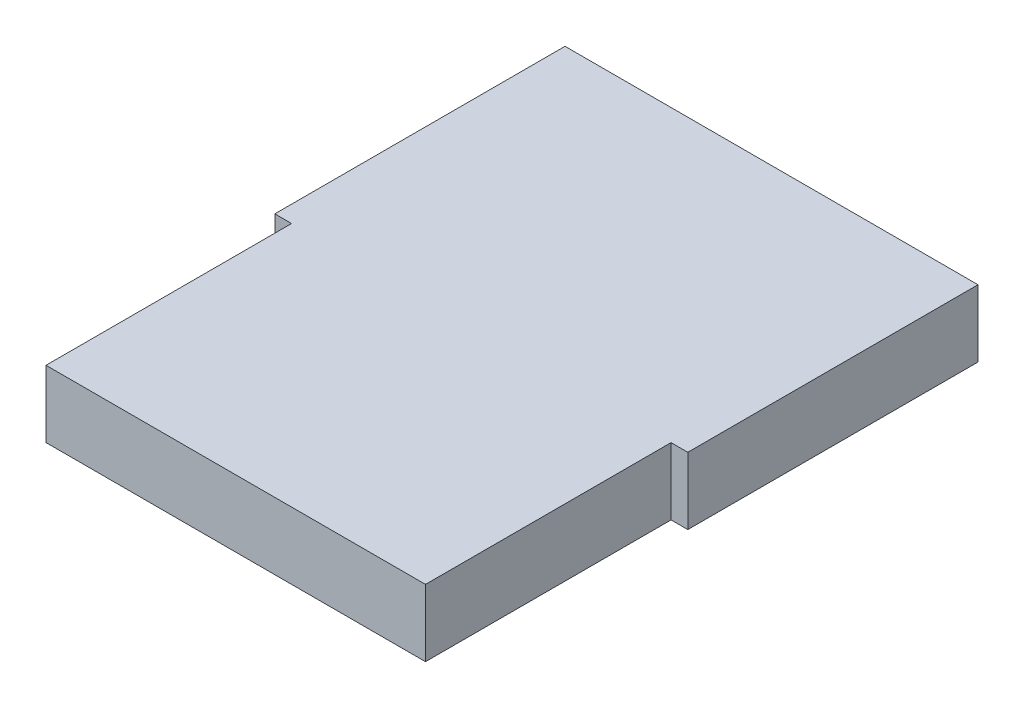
ISO-10303-21;
HEADER;
FILE_DESCRIPTION(('STEP AP214'),'2;1');
FILE_NAME('part.step','',(''),(''),'','','');
FILE_SCHEMA(('AUTOMOTIVE_DESIGN { 1 0 10303 214 1 1 1 1 }'));
ENDSEC;
DATA;
#1=APPLICATION_CONTEXT('core data for automotive mechanical design processes');
#2=APPLICATION_PROTOCOL_DEFINITION('international standard','automotive_design',2000,#1);
#3=PRODUCT_CONTEXT('',#1,'mechanical');
#4=PRODUCT('Part','Part','',(#3));
#5=PRODUCT_RELATED_PRODUCT_CATEGORY('part','',(#4));
#6=PRODUCT_DEFINITION_FORMATION('','',#4);
#7=PRODUCT_DEFINITION_CONTEXT('part definition',#1,'design');
#8=PRODUCT_DEFINITION('design','',#6,#7);
#9=PRODUCT_DEFINITION_SHAPE('','',#8);
#10=(LENGTH_UNIT() NAMED_UNIT(*) SI_UNIT(.MILLI.,.METRE.));
#11=(NAMED_UNIT(*) PLANE_ANGLE_UNIT() SI_UNIT($,.RADIAN.));
#12=(NAMED_UNIT(*) SI_UNIT($,.STERADIAN.) SOLID_ANGLE_UNIT());
#13=UNCERTAINTY_MEASURE_WITH_UNIT(LENGTH_MEASURE(1.E-05),#10,'distance_accuracy_value','');
#14=(GEOMETRIC_REPRESENTATION_CONTEXT(3) GLOBAL_UNCERTAINTY_ASSIGNED_CONTEXT((#13)) GLOBAL_UNIT_ASSIGNED_CONTEXT((#10,
#11,#12)) REPRESENTATION_CONTEXT('',''));
#15=CARTESIAN_POINT('',(0.,0.,0.));
#16=DIRECTION('',(0.,0.,1.));
#17=DIRECTION('',(1.,0.,0.));
#18=AXIS2_PLACEMENT_3D('',#15,#16,#17);
#19=CARTESIAN_POINT('',(-46.1103954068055,-22.5,4.));
#20=DIRECTION('',(0.,1.,0.));
#21=DIRECTION('',(-1.,0.,0.));
#22=AXIS2_PLACEMENT_3D('',#19,#20,#21);
#23=PLANE('',#22);
#24=DIRECTION('',(0.,0.,1.));
#25=VECTOR('',#24,1.);
#26=CARTESIAN_POINT('',(-44.6103954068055,-22.5,4.));
#27=LINE('',#26,#25);
#28=CARTESIAN_POINT('',(-44.6103954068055,-22.5,26.));
#29=VERTEX_POINT('',#28);
#30=CARTESIAN_POINT('',(-44.6103954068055,-22.5,48.));
#31=VERTEX_POINT('',#30);
#32=EDGE_CURVE('E55',#29,#31,#27,.T.);
#33=ORIENTED_EDGE('',*,*,#32,.F.);
#34=DIRECTION('',(-1.,0.,0.));
#35=VECTOR('',#34,1.);
#36=CARTESIAN_POINT('',(-46.1103954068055,-22.5,26.));
#37=LINE('',#36,#35);
#38=CARTESIAN_POINT('',(-46.1103954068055,-22.5,26.));
#39=VERTEX_POINT('',#38);
#40=EDGE_CURVE('E154',#29,#39,#37,.T.);
#41=ORIENTED_EDGE('',*,*,#40,.T.);
#42=DIRECTION('',(0.,0.,-1.));
#43=VECTOR('',#42,1.);
#44=CARTESIAN_POINT('',(-46.1103954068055,-22.5,4.));
#45=LINE('',#44,#43);
#46=CARTESIAN_POINT('',(-46.1103954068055,-22.5,0.));
#47=VERTEX_POINT('',#46);
#48=EDGE_CURVE('E126',#39,#47,#45,.T.);
#49=ORIENTED_EDGE('',*,*,#48,.T.);
#50=DIRECTION('',(1.,0.,0.));
#51=VECTOR('',#50,1.);
#52=CARTESIAN_POINT('',(-46.1103954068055,-22.5,0.));
#53=LINE('',#52,#51);
#54=CARTESIAN_POINT('',(-9.11039540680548,-22.5,0.));
#55=VERTEX_POINT('',#54);
#56=EDGE_CURVE('E124',#47,#55,#53,.T.);
#57=ORIENTED_EDGE('',*,*,#56,.T.);
#58=DIRECTION('',(0.,0.,-1.));
#59=VECTOR('',#58,1.);
#60=CARTESIAN_POINT('',(-9.11039540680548,-22.5,4.));
#61=LINE('',#60,#59);
#62=CARTESIAN_POINT('',(-9.11039540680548,-22.5,26.));
#63=VERTEX_POINT('',#62);
#64=EDGE_CURVE('E122',#63,#55,#61,.T.);
#65=ORIENTED_EDGE('',*,*,#64,.F.);
#66=DIRECTION('',(1.,0.,0.));
#67=VECTOR('',#66,1.);
#68=CARTESIAN_POINT('',(-46.1103954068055,-22.5,26.));
#69=LINE('',#68,#67);
#70=CARTESIAN_POINT('',(-10.6103954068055,-22.5,26.));
#71=VERTEX_POINT('',#70);
#72=EDGE_CURVE('E148',#71,#63,#69,.T.);
#73=ORIENTED_EDGE('',*,*,#72,.F.);
#74=DIRECTION('',(0.,0.,1.));
#75=VECTOR('',#74,1.);
#76=CARTESIAN_POINT('',(-10.6103954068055,-22.5,3.99999999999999));
#77=LINE('',#76,#75);
#78=CARTESIAN_POINT('',(-10.6103954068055,-22.5,48.));
#79=VERTEX_POINT('',#78);
#80=EDGE_CURVE('E166',#71,#79,#77,.T.);
#81=ORIENTED_EDGE('',*,*,#80,.T.);
#82=DIRECTION('',(1.,0.,0.));
#83=VECTOR('',#82,1.);
#84=CARTESIAN_POINT('',(-46.1103954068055,-22.5,48.));
#85=LINE('',#84,#83);
#86=EDGE_CURVE('E140',#31,#79,#85,.T.);
#87=ORIENTED_EDGE('',*,*,#86,.F.);
#88=EDGE_LOOP('',(#33,#41,#49,#57,#65,#73,#81,#87));
#89=FACE_BOUND('',#88,.T.);
#90=ADVANCED_FACE('F33',(#89),#23,.F.);
#91=CARTESIAN_POINT('',(-46.1103954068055,-16.5,48.));
#92=DIRECTION('',(0.,-1.,0.));
#93=DIRECTION('',(0.,0.,-1.));
#94=AXIS2_PLACEMENT_3D('',#91,#92,#93);
#95=PLANE('',#94);
#96=DIRECTION('',(0.,0.,1.));
#97=VECTOR('',#96,1.);
#98=CARTESIAN_POINT('',(-44.6103954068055,-16.5,0.));
#99=LINE('',#98,#97);
#100=CARTESIAN_POINT('',(-44.6103954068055,-16.5,26.));
#101=VERTEX_POINT('',#100);
#102=CARTESIAN_POINT('',(-44.6103954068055,-16.5,48.));
#103=VERTEX_POINT('',#102);
#104=EDGE_CURVE('E118',#101,#103,#99,.T.);
#105=ORIENTED_EDGE('',*,*,#104,.T.);
#106=DIRECTION('',(-1.,0.,0.));
#107=VECTOR('',#106,1.);
#108=CARTESIAN_POINT('',(-46.1103954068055,-16.5,48.));
#109=LINE('',#108,#107);
#110=CARTESIAN_POINT('',(-10.6103954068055,-16.5,48.));
#111=VERTEX_POINT('',#110);
#112=EDGE_CURVE('E138',#111,#103,#109,.T.);
#113=ORIENTED_EDGE('',*,*,#112,.F.);
#114=DIRECTION('',(0.,0.,1.));
#115=VECTOR('',#114,1.);
#116=CARTESIAN_POINT('',(-10.6103954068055,-16.5,0.));
#117=LINE('',#116,#115);
#118=CARTESIAN_POINT('',(-10.6103954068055,-16.5,26.));
#119=VERTEX_POINT('',#118);
#120=EDGE_CURVE('E143',#119,#111,#117,.T.);
#121=ORIENTED_EDGE('',*,*,#120,.F.);
#122=DIRECTION('',(1.,0.,0.));
#123=VECTOR('',#122,1.);
#124=CARTESIAN_POINT('',(0.,-16.5,26.));
#125=LINE('',#124,#123);
#126=CARTESIAN_POINT('',(-9.11039540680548,-16.5,26.));
#127=VERTEX_POINT('',#126);
#128=EDGE_CURVE('E107',#119,#127,#125,.T.);
#129=ORIENTED_EDGE('',*,*,#128,.T.);
#130=DIRECTION('',(0.,0.,-1.));
#131=VECTOR('',#130,1.);
#132=CARTESIAN_POINT('',(-9.11039540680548,-16.5,48.));
#133=LINE('',#132,#131);
#134=CARTESIAN_POINT('',(-9.11039540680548,-16.5,0.));
#135=VERTEX_POINT('',#134);
#136=EDGE_CURVE('E99',#127,#135,#133,.T.);
#137=ORIENTED_EDGE('',*,*,#136,.T.);
#138=DIRECTION('',(1.,0.,0.));
#139=VECTOR('',#138,1.);
#140=CARTESIAN_POINT('',(-27.6103954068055,-16.5,0.));
#141=LINE('',#140,#139);
#142=CARTESIAN_POINT('',(-46.1103954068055,-16.5,0.));
#143=VERTEX_POINT('',#142);
#144=EDGE_CURVE('E103',#143,#135,#141,.T.);
#145=ORIENTED_EDGE('',*,*,#144,.F.);
#146=DIRECTION('',(0.,0.,-1.));
#147=VECTOR('',#146,1.);
#148=CARTESIAN_POINT('',(-46.1103954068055,-16.5,48.));
#149=LINE('',#148,#147);
#150=CARTESIAN_POINT('',(-46.1103954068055,-16.5,26.));
#151=VERTEX_POINT('',#150);
#152=EDGE_CURVE('E48',#151,#143,#149,.T.);
#153=ORIENTED_EDGE('',*,*,#152,.F.);
#154=DIRECTION('',(-1.,0.,0.));
#155=VECTOR('',#154,1.);
#156=CARTESIAN_POINT('',(0.,-16.5,26.));
#157=LINE('',#156,#155);
#158=EDGE_CURVE('E266',#101,#151,#157,.T.);
#159=ORIENTED_EDGE('',*,*,#158,.F.);
#160=EDGE_LOOP('',(#105,#113,#121,#129,#137,#145,#153,#159));
#161=FACE_BOUND('',#160,.T.);
#162=ADVANCED_FACE('F102',(#161),#95,.F.);
#163=CARTESIAN_POINT('',(0.,0.,48.));
#164=DIRECTION('',(0.,0.,-1.));
#165=DIRECTION('',(-1.,0.,0.));
#166=AXIS2_PLACEMENT_3D('',#163,#164,#165);
#167=PLANE('',#166);
#168=DIRECTION('',(0.,1.,0.));
#169=VECTOR('',#168,1.);
#170=CARTESIAN_POINT('',(-44.6103954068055,0.,48.));
#171=LINE('',#170,#169);
#172=EDGE_CURVE('E11',#31,#103,#171,.T.);
#173=ORIENTED_EDGE('',*,*,#172,.F.);
#174=ORIENTED_EDGE('',*,*,#86,.T.);
#175=DIRECTION('',(0.,1.,0.));
#176=VECTOR('',#175,1.);
#177=CARTESIAN_POINT('',(-10.6103954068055,0.,48.));
#178=LINE('',#177,#176);
#179=EDGE_CURVE('E41',#79,#111,#178,.T.);
#180=ORIENTED_EDGE('',*,*,#179,.T.);
#181=ORIENTED_EDGE('',*,*,#112,.T.);
#182=EDGE_LOOP('',(#173,#174,#180,#181));
#183=FACE_BOUND('',#182,.T.);
#184=ADVANCED_FACE('F137',(#183),#167,.F.);
#185=CARTESIAN_POINT('',(-9.11039540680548,0.,4.));
#186=DIRECTION('',(-1.,0.,0.));
#187=DIRECTION('',(0.,-1.,0.));
#188=AXIS2_PLACEMENT_3D('',#185,#186,#187);
#189=PLANE('',#188);
#190=DIRECTION('',(0.,1.,0.));
#191=VECTOR('',#190,1.);
#192=CARTESIAN_POINT('',(-9.11039540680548,0.,0.));
#193=LINE('',#192,#191);
#194=EDGE_CURVE('E117',#55,#135,#193,.T.);
#195=ORIENTED_EDGE('',*,*,#194,.T.);
#196=ORIENTED_EDGE('',*,*,#136,.F.);
#197=DIRECTION('',(0.,1.,0.));
#198=VECTOR('',#197,1.);
#199=CARTESIAN_POINT('',(-9.11039540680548,-26.5,26.));
#200=LINE('',#199,#198);
#201=EDGE_CURVE('E164',#63,#127,#200,.T.);
#202=ORIENTED_EDGE('',*,*,#201,.F.);
#203=ORIENTED_EDGE('',*,*,#64,.T.);
#204=EDGE_LOOP('',(#195,#196,#202,#203));
#205=FACE_BOUND('',#204,.T.);
#206=ADVANCED_FACE('F120',(#205),#189,.F.);
#207=CARTESIAN_POINT('',(-27.6103954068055,0.,0.));
#208=DIRECTION('',(0.,0.,1.));
#209=DIRECTION('',(1.,0.,0.));
#210=AXIS2_PLACEMENT_3D('',#207,#208,#209);
#211=PLANE('',#210);
#212=DIRECTION('',(0.,-1.,0.));
#213=VECTOR('',#212,1.);
#214=CARTESIAN_POINT('',(-46.1103954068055,0.,0.));
#215=LINE('',#214,#213);
#216=EDGE_CURVE('E111',#143,#47,#215,.T.);
#217=ORIENTED_EDGE('',*,*,#216,.F.);
#218=ORIENTED_EDGE('',*,*,#144,.T.);
#219=ORIENTED_EDGE('',*,*,#194,.F.);
#220=ORIENTED_EDGE('',*,*,#56,.F.);
#221=EDGE_LOOP('',(#217,#218,#219,#220));
#222=FACE_BOUND('',#221,.T.);
#223=ADVANCED_FACE('F115',(#222),#211,.F.);
#224=CARTESIAN_POINT('',(-46.1103954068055,0.,4.));
#225=DIRECTION('',(1.,0.,0.));
#226=DIRECTION('',(0.,0.,-1.));
#227=AXIS2_PLACEMENT_3D('',#224,#225,#226);
#228=PLANE('',#227);
#229=ORIENTED_EDGE('',*,*,#152,.T.);
#230=ORIENTED_EDGE('',*,*,#216,.T.);
#231=ORIENTED_EDGE('',*,*,#48,.F.);
#232=DIRECTION('',(0.,1.,0.));
#233=VECTOR('',#232,1.);
#234=CARTESIAN_POINT('',(-46.1103954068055,-26.5,26.));
#235=LINE('',#234,#233);
#236=EDGE_CURVE('E158',#39,#151,#235,.T.);
#237=ORIENTED_EDGE('',*,*,#236,.T.);
#238=EDGE_LOOP('',(#229,#230,#231,#237));
#239=FACE_BOUND('',#238,.T.);
#240=ADVANCED_FACE('F35',(#239),#228,.F.);
#241=CARTESIAN_POINT('',(0.,-26.5,26.));
#242=DIRECTION('',(0.,0.,1.));
#243=DIRECTION('',(1.,0.,0.));
#244=AXIS2_PLACEMENT_3D('',#241,#242,#243);
#245=PLANE('',#244);
#246=ORIENTED_EDGE('',*,*,#72,.T.);
#247=ORIENTED_EDGE('',*,*,#201,.T.);
#248=ORIENTED_EDGE('',*,*,#128,.F.);
#249=DIRECTION('',(0.,1.,0.));
#250=VECTOR('',#249,1.);
#251=CARTESIAN_POINT('',(-10.6103954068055,-26.5,26.));
#252=LINE('',#251,#250);
#253=EDGE_CURVE('E163',#71,#119,#252,.T.);
#254=ORIENTED_EDGE('',*,*,#253,.F.);
#255=EDGE_LOOP('',(#246,#247,#248,#254));
#256=FACE_BOUND('',#255,.T.);
#257=ADVANCED_FACE('F171',(#256),#245,.T.);
#258=CARTESIAN_POINT('',(-10.6103954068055,-26.5,0.));
#259=DIRECTION('',(-1.,0.,0.));
#260=DIRECTION('',(0.,0.,1.));
#261=AXIS2_PLACEMENT_3D('',#258,#259,#260);
#262=PLANE('',#261);
#263=ORIENTED_EDGE('',*,*,#253,.T.);
#264=ORIENTED_EDGE('',*,*,#120,.T.);
#265=ORIENTED_EDGE('',*,*,#179,.F.);
#266=ORIENTED_EDGE('',*,*,#80,.F.);
#267=EDGE_LOOP('',(#263,#264,#265,#266));
#268=FACE_BOUND('',#267,.T.);
#269=ADVANCED_FACE('F172',(#268),#262,.F.);
#270=CARTESIAN_POINT('',(0.,-26.5,26.));
#271=DIRECTION('',(0.,0.,-1.));
#272=DIRECTION('',(-1.,0.,0.));
#273=AXIS2_PLACEMENT_3D('',#270,#271,#272);
#274=PLANE('',#273);
#275=DIRECTION('',(0.,1.,0.));
#276=VECTOR('',#275,1.);
#277=CARTESIAN_POINT('',(-44.6103954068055,-26.5,26.));
#278=LINE('',#277,#276);
#279=EDGE_CURVE('E265',#29,#101,#278,.T.);
#280=ORIENTED_EDGE('',*,*,#279,.T.);
#281=ORIENTED_EDGE('',*,*,#158,.T.);
#282=ORIENTED_EDGE('',*,*,#236,.F.);
#283=ORIENTED_EDGE('',*,*,#40,.F.);
#284=EDGE_LOOP('',(#280,#281,#282,#283));
#285=FACE_BOUND('',#284,.T.);
#286=ADVANCED_FACE('F174',(#285),#274,.F.);
#287=CARTESIAN_POINT('',(-44.6103954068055,-26.5,0.));
#288=DIRECTION('',(-1.,0.,0.));
#289=DIRECTION('',(0.,0.,1.));
#290=AXIS2_PLACEMENT_3D('',#287,#288,#289);
#291=PLANE('',#290);
#292=ORIENTED_EDGE('',*,*,#32,.T.);
#293=ORIENTED_EDGE('',*,*,#172,.T.);
#294=ORIENTED_EDGE('',*,*,#104,.F.);
#295=ORIENTED_EDGE('',*,*,#279,.F.);
#296=EDGE_LOOP('',(#292,#293,#294,#295));
#297=FACE_BOUND('',#296,.T.);
#298=ADVANCED_FACE('F180',(#297),#291,.T.);
#299=CLOSED_SHELL('',(#90,#162,#184,#206,#223,#240,#257,#269,#286,#298));
#300=MANIFOLD_SOLID_BREP('B2',#299);
#301=ADVANCED_BREP_SHAPE_REPRESENTATION('',(#18,#300),#14);
#302=SHAPE_DEFINITION_REPRESENTATION(#9,#301);
ENDSEC;
END-ISO-10303-21;
